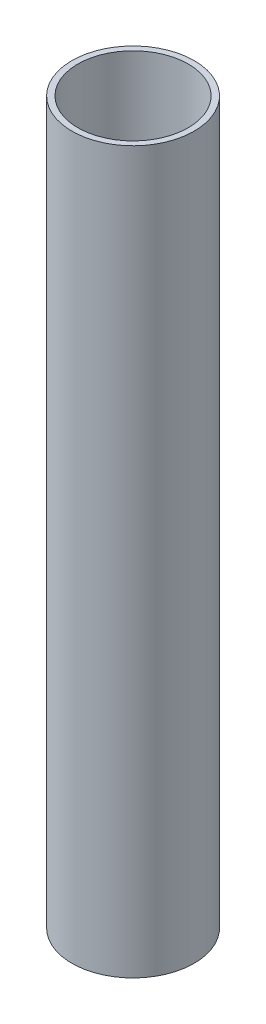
ISO-10303-21;
HEADER;
FILE_DESCRIPTION(('STEP AP214'),'2;1');
FILE_NAME('part.step','',(''),(''),'','','');
FILE_SCHEMA(('AUTOMOTIVE_DESIGN { 1 0 10303 214 1 1 1 1 }'));
ENDSEC;
DATA;
#1=APPLICATION_CONTEXT('core data for automotive mechanical design processes');
#2=APPLICATION_PROTOCOL_DEFINITION('international standard','automotive_design',2000,#1);
#3=PRODUCT_CONTEXT('',#1,'mechanical');
#4=PRODUCT('Part','Part','',(#3));
#5=PRODUCT_RELATED_PRODUCT_CATEGORY('part','',(#4));
#6=PRODUCT_DEFINITION_FORMATION('','',#4);
#7=PRODUCT_DEFINITION_CONTEXT('part definition',#1,'design');
#8=PRODUCT_DEFINITION('design','',#6,#7);
#9=PRODUCT_DEFINITION_SHAPE('','',#8);
#10=(LENGTH_UNIT() NAMED_UNIT(*) SI_UNIT(.MILLI.,.METRE.));
#11=(NAMED_UNIT(*) PLANE_ANGLE_UNIT() SI_UNIT($,.RADIAN.));
#12=(NAMED_UNIT(*) SI_UNIT($,.STERADIAN.) SOLID_ANGLE_UNIT());
#13=UNCERTAINTY_MEASURE_WITH_UNIT(LENGTH_MEASURE(1.E-05),#10,'distance_accuracy_value','');
#14=(GEOMETRIC_REPRESENTATION_CONTEXT(3) GLOBAL_UNCERTAINTY_ASSIGNED_CONTEXT((#13)) GLOBAL_UNIT_ASSIGNED_CONTEXT((#10,
#11,#12)) REPRESENTATION_CONTEXT('',''));
#15=CARTESIAN_POINT('',(0.,0.,0.));
#16=DIRECTION('',(0.,0.,1.));
#17=DIRECTION('',(1.,0.,0.));
#18=AXIS2_PLACEMENT_3D('',#15,#16,#17);
#19=CARTESIAN_POINT('',(0.,122.,0.));
#20=DIRECTION('',(0.,1.,0.));
#21=DIRECTION('',(0.,0.,1.));
#22=AXIS2_PLACEMENT_3D('',#19,#20,#21);
#23=PLANE('',#22);
#24=CARTESIAN_POINT('',(0.,122.,0.));
#25=DIRECTION('',(0.,1.,0.));
#26=DIRECTION('',(0.,0.,1.));
#27=AXIS2_PLACEMENT_3D('',#24,#25,#26);
#28=CIRCLE('',#27,10.35);
#29=CARTESIAN_POINT('',(0.,122.,-10.35));
#30=VERTEX_POINT('',#29);
#31=EDGE_CURVE('E10',#30,#30,#28,.T.);
#32=ORIENTED_EDGE('',*,*,#31,.T.);
#33=EDGE_LOOP('',(#32));
#34=FACE_BOUND('',#33,.T.);
#35=CARTESIAN_POINT('',(0.,122.,0.));
#36=DIRECTION('',(0.,1.,0.));
#37=DIRECTION('',(0.,0.,1.));
#38=AXIS2_PLACEMENT_3D('',#35,#36,#37);
#39=CIRCLE('',#38,9.35);
#40=CARTESIAN_POINT('',(0.,122.,-9.35));
#41=VERTEX_POINT('',#40);
#42=EDGE_CURVE('E56',#41,#41,#39,.T.);
#43=ORIENTED_EDGE('',*,*,#42,.F.);
#44=EDGE_LOOP('',(#43));
#45=FACE_BOUND('',#44,.T.);
#46=ADVANCED_FACE('F43',(#34,#45),#23,.T.);
#47=CARTESIAN_POINT('',(0.,0.,0.));
#48=DIRECTION('',(0.,1.,0.));
#49=DIRECTION('',(0.,0.,1.));
#50=AXIS2_PLACEMENT_3D('',#47,#48,#49);
#51=PLANE('',#50);
#52=CARTESIAN_POINT('',(0.,0.,0.));
#53=DIRECTION('',(0.,1.,0.));
#54=DIRECTION('',(0.,0.,1.));
#55=AXIS2_PLACEMENT_3D('',#52,#53,#54);
#56=CIRCLE('',#55,10.35);
#57=CARTESIAN_POINT('',(0.,0.,-10.35));
#58=VERTEX_POINT('',#57);
#59=EDGE_CURVE('E47',#58,#58,#56,.T.);
#60=ORIENTED_EDGE('',*,*,#59,.F.);
#61=EDGE_LOOP('',(#60));
#62=FACE_BOUND('',#61,.T.);
#63=CARTESIAN_POINT('',(0.,0.,0.));
#64=DIRECTION('',(0.,1.,0.));
#65=DIRECTION('',(0.,0.,1.));
#66=AXIS2_PLACEMENT_3D('',#63,#64,#65);
#67=CIRCLE('',#66,9.35);
#68=CARTESIAN_POINT('',(0.,0.,-9.35));
#69=VERTEX_POINT('',#68);
#70=EDGE_CURVE('E58',#69,#69,#67,.T.);
#71=ORIENTED_EDGE('',*,*,#70,.T.);
#72=EDGE_LOOP('',(#71));
#73=FACE_BOUND('',#72,.T.);
#74=ADVANCED_FACE('F70',(#62,#73),#51,.F.);
#75=CARTESIAN_POINT('',(0.,122.,0.));
#76=DIRECTION('',(0.,-1.,0.));
#77=DIRECTION('',(0.,0.,-1.));
#78=AXIS2_PLACEMENT_3D('',#75,#76,#77);
#79=CYLINDRICAL_SURFACE('',#78,10.35);
#80=CARTESIAN_POINT('',(0.,122.,-10.35));
#81=CARTESIAN_POINT('',(0.,120.729166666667,-10.35));
#82=CARTESIAN_POINT('',(0.,119.458333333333,-10.35));
#83=CARTESIAN_POINT('',(0.,116.916666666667,-10.35));
#84=CARTESIAN_POINT('',(0.,115.645833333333,-10.35));
#85=CARTESIAN_POINT('',(0.,113.104166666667,-10.35));
#86=CARTESIAN_POINT('',(0.,111.833333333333,-10.35));
#87=CARTESIAN_POINT('',(0.,109.291666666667,-10.35));
#88=CARTESIAN_POINT('',(0.,108.020833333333,-10.35));
#89=CARTESIAN_POINT('',(0.,105.479166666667,-10.35));
#90=CARTESIAN_POINT('',(0.,104.208333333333,-10.35));
#91=CARTESIAN_POINT('',(0.,101.666666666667,-10.35));
#92=CARTESIAN_POINT('',(0.,100.395833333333,-10.35));
#93=CARTESIAN_POINT('',(0.,97.8541666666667,-10.35));
#94=CARTESIAN_POINT('',(0.,96.5833333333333,-10.35));
#95=CARTESIAN_POINT('',(0.,94.0416666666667,-10.35));
#96=CARTESIAN_POINT('',(0.,92.7708333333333,-10.35));
#97=CARTESIAN_POINT('',(0.,90.2291666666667,-10.35));
#98=CARTESIAN_POINT('',(0.,88.9583333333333,-10.35));
#99=CARTESIAN_POINT('',(0.,86.4166666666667,-10.35));
#100=CARTESIAN_POINT('',(0.,85.1458333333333,-10.35));
#101=CARTESIAN_POINT('',(0.,82.6041666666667,-10.35));
#102=CARTESIAN_POINT('',(0.,81.3333333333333,-10.35));
#103=CARTESIAN_POINT('',(0.,78.7916666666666,-10.35));
#104=CARTESIAN_POINT('',(0.,77.5208333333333,-10.35));
#105=CARTESIAN_POINT('',(0.,74.9791666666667,-10.35));
#106=CARTESIAN_POINT('',(0.,73.7083333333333,-10.35));
#107=CARTESIAN_POINT('',(0.,71.1666666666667,-10.35));
#108=CARTESIAN_POINT('',(0.,69.8958333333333,-10.35));
#109=CARTESIAN_POINT('',(0.,67.3541666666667,-10.35));
#110=CARTESIAN_POINT('',(0.,66.0833333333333,-10.35));
#111=CARTESIAN_POINT('',(0.,63.5416666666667,-10.35));
#112=CARTESIAN_POINT('',(0.,62.2708333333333,-10.35));
#113=CARTESIAN_POINT('',(0.,59.7291666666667,-10.35));
#114=CARTESIAN_POINT('',(0.,58.4583333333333,-10.35));
#115=CARTESIAN_POINT('',(0.,55.9166666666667,-10.35));
#116=CARTESIAN_POINT('',(0.,54.6458333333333,-10.35));
#117=CARTESIAN_POINT('',(0.,52.1041666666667,-10.35));
#118=CARTESIAN_POINT('',(0.,50.8333333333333,-10.35));
#119=CARTESIAN_POINT('',(0.,48.2916666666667,-10.35));
#120=CARTESIAN_POINT('',(0.,47.0208333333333,-10.35));
#121=CARTESIAN_POINT('',(0.,44.4791666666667,-10.35));
#122=CARTESIAN_POINT('',(0.,43.2083333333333,-10.35));
#123=CARTESIAN_POINT('',(0.,40.6666666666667,-10.35));
#124=CARTESIAN_POINT('',(0.,39.3958333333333,-10.35));
#125=CARTESIAN_POINT('',(0.,36.8541666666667,-10.35));
#126=CARTESIAN_POINT('',(0.,35.5833333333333,-10.35));
#127=CARTESIAN_POINT('',(0.,33.0416666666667,-10.35));
#128=CARTESIAN_POINT('',(0.,31.7708333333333,-10.35));
#129=CARTESIAN_POINT('',(0.,29.2291666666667,-10.35));
#130=CARTESIAN_POINT('',(0.,27.9583333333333,-10.35));
#131=CARTESIAN_POINT('',(0.,25.4166666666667,-10.35));
#132=CARTESIAN_POINT('',(0.,24.1458333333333,-10.35));
#133=CARTESIAN_POINT('',(0.,21.6041666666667,-10.35));
#134=CARTESIAN_POINT('',(0.,20.3333333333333,-10.35));
#135=CARTESIAN_POINT('',(0.,17.7916666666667,-10.35));
#136=CARTESIAN_POINT('',(0.,16.5208333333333,-10.35));
#137=CARTESIAN_POINT('',(0.,13.9791666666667,-10.35));
#138=CARTESIAN_POINT('',(0.,12.7083333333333,-10.35));
#139=CARTESIAN_POINT('',(0.,10.1666666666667,-10.35));
#140=CARTESIAN_POINT('',(0.,8.89583333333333,-10.35));
#141=CARTESIAN_POINT('',(0.,6.35416666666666,-10.35));
#142=CARTESIAN_POINT('',(0.,5.08333333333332,-10.35));
#143=CARTESIAN_POINT('',(0.,2.54166666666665,-10.35));
#144=CARTESIAN_POINT('',(0.,1.27083333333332,-10.35));
#145=CARTESIAN_POINT('',(0.,0.,-10.35));
#146=B_SPLINE_CURVE_WITH_KNOTS('',3,(#80,#81,#82,#83,#84,#85,#86,#87,#88,#89,#90,#91,#92,#93,
#94,#95,#96,#97,#98,#99,#100,#101,#102,#103,#104,#105,#106,#107,#108,#109,#110,#111,#112,#113,
#114,#115,#116,#117,#118,#119,#120,#121,#122,#123,#124,#125,#126,#127,#128,#129,#130,#131,#132,
#133,#134,#135,#136,#137,#138,#139,#140,#141,#142,#143,#144,#145),.UNSPECIFIED.,.F.,.F.,(4,2,2,
2,2,2,2,2,2,2,2,2,2,2,2,2,2,2,2,2,2,2,2,2,2,2,2,2,2,2,2,2,4),(0.,3.81250000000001,
7.62500000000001,11.4375,15.25,19.0625,22.875,26.6875,30.5,34.3125,38.125,41.9375,45.75,49.5625,
53.375,57.1875,61.,64.8125,68.625,72.4375,76.25,80.0625,83.875,87.6875,91.5,95.3125,99.125,
102.9375,106.75,110.5625,114.375,118.1875,122.),.UNSPECIFIED.);
#147=EDGE_CURVE('BSEAM45',#30,#58,#146,.T.);
#148=ORIENTED_EDGE('',*,*,#31,.F.);
#149=ORIENTED_EDGE('',*,*,#59,.T.);
#150=ORIENTED_EDGE('',*,*,#147,.T.);
#151=ORIENTED_EDGE('',*,*,#147,.F.);
#152=EDGE_LOOP('',(#148,#150,#149,#151));
#153=FACE_BOUND('',#152,.T.);
#154=ADVANCED_FACE('F45',(#153),#79,.T.);
#155=CARTESIAN_POINT('',(0.,122.,0.));
#156=DIRECTION('',(0.,-1.,0.));
#157=DIRECTION('',(0.,0.,-1.));
#158=AXIS2_PLACEMENT_3D('',#155,#156,#157);
#159=CYLINDRICAL_SURFACE('',#158,9.35);
#160=CARTESIAN_POINT('',(0.,122.,-9.35));
#161=CARTESIAN_POINT('',(0.,120.729166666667,-9.35));
#162=CARTESIAN_POINT('',(0.,119.458333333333,-9.35));
#163=CARTESIAN_POINT('',(0.,116.916666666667,-9.35));
#164=CARTESIAN_POINT('',(0.,115.645833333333,-9.35));
#165=CARTESIAN_POINT('',(0.,113.104166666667,-9.35));
#166=CARTESIAN_POINT('',(0.,111.833333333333,-9.35));
#167=CARTESIAN_POINT('',(0.,109.291666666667,-9.35));
#168=CARTESIAN_POINT('',(0.,108.020833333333,-9.35));
#169=CARTESIAN_POINT('',(0.,105.479166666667,-9.35));
#170=CARTESIAN_POINT('',(0.,104.208333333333,-9.35));
#171=CARTESIAN_POINT('',(0.,101.666666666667,-9.35));
#172=CARTESIAN_POINT('',(0.,100.395833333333,-9.35));
#173=CARTESIAN_POINT('',(0.,97.8541666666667,-9.35));
#174=CARTESIAN_POINT('',(0.,96.5833333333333,-9.35));
#175=CARTESIAN_POINT('',(0.,94.0416666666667,-9.35));
#176=CARTESIAN_POINT('',(0.,92.7708333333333,-9.35));
#177=CARTESIAN_POINT('',(0.,90.2291666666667,-9.35));
#178=CARTESIAN_POINT('',(0.,88.9583333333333,-9.35));
#179=CARTESIAN_POINT('',(0.,86.4166666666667,-9.35));
#180=CARTESIAN_POINT('',(0.,85.1458333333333,-9.35));
#181=CARTESIAN_POINT('',(0.,82.6041666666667,-9.35));
#182=CARTESIAN_POINT('',(0.,81.3333333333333,-9.35));
#183=CARTESIAN_POINT('',(0.,78.7916666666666,-9.35));
#184=CARTESIAN_POINT('',(0.,77.5208333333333,-9.35));
#185=CARTESIAN_POINT('',(0.,74.9791666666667,-9.35));
#186=CARTESIAN_POINT('',(0.,73.7083333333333,-9.35));
#187=CARTESIAN_POINT('',(0.,71.1666666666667,-9.35));
#188=CARTESIAN_POINT('',(0.,69.8958333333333,-9.35));
#189=CARTESIAN_POINT('',(0.,67.3541666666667,-9.35));
#190=CARTESIAN_POINT('',(0.,66.0833333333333,-9.35));
#191=CARTESIAN_POINT('',(0.,63.5416666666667,-9.35));
#192=CARTESIAN_POINT('',(0.,62.2708333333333,-9.35));
#193=CARTESIAN_POINT('',(0.,59.7291666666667,-9.35));
#194=CARTESIAN_POINT('',(0.,58.4583333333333,-9.35));
#195=CARTESIAN_POINT('',(0.,55.9166666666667,-9.35));
#196=CARTESIAN_POINT('',(0.,54.6458333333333,-9.35));
#197=CARTESIAN_POINT('',(0.,52.1041666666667,-9.35));
#198=CARTESIAN_POINT('',(0.,50.8333333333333,-9.35));
#199=CARTESIAN_POINT('',(0.,48.2916666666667,-9.35));
#200=CARTESIAN_POINT('',(0.,47.0208333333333,-9.35));
#201=CARTESIAN_POINT('',(0.,44.4791666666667,-9.35));
#202=CARTESIAN_POINT('',(0.,43.2083333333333,-9.35));
#203=CARTESIAN_POINT('',(0.,40.6666666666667,-9.35));
#204=CARTESIAN_POINT('',(0.,39.3958333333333,-9.35));
#205=CARTESIAN_POINT('',(0.,36.8541666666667,-9.35));
#206=CARTESIAN_POINT('',(0.,35.5833333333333,-9.35));
#207=CARTESIAN_POINT('',(0.,33.0416666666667,-9.35));
#208=CARTESIAN_POINT('',(0.,31.7708333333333,-9.35));
#209=CARTESIAN_POINT('',(0.,29.2291666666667,-9.35));
#210=CARTESIAN_POINT('',(0.,27.9583333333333,-9.35));
#211=CARTESIAN_POINT('',(0.,25.4166666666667,-9.35));
#212=CARTESIAN_POINT('',(0.,24.1458333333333,-9.35));
#213=CARTESIAN_POINT('',(0.,21.6041666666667,-9.35));
#214=CARTESIAN_POINT('',(0.,20.3333333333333,-9.35));
#215=CARTESIAN_POINT('',(0.,17.7916666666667,-9.35));
#216=CARTESIAN_POINT('',(0.,16.5208333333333,-9.35));
#217=CARTESIAN_POINT('',(0.,13.9791666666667,-9.35));
#218=CARTESIAN_POINT('',(0.,12.7083333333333,-9.35));
#219=CARTESIAN_POINT('',(0.,10.1666666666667,-9.35));
#220=CARTESIAN_POINT('',(0.,8.89583333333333,-9.35));
#221=CARTESIAN_POINT('',(0.,6.35416666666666,-9.35));
#222=CARTESIAN_POINT('',(0.,5.08333333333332,-9.35));
#223=CARTESIAN_POINT('',(0.,2.54166666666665,-9.35));
#224=CARTESIAN_POINT('',(0.,1.27083333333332,-9.35));
#225=CARTESIAN_POINT('',(0.,0.,-9.35));
#226=B_SPLINE_CURVE_WITH_KNOTS('',3,(#160,#161,#162,#163,#164,#165,#166,#167,#168,#169,#170,
#171,#172,#173,#174,#175,#176,#177,#178,#179,#180,#181,#182,#183,#184,#185,#186,#187,#188,#189,
#190,#191,#192,#193,#194,#195,#196,#197,#198,#199,#200,#201,#202,#203,#204,#205,#206,#207,#208,
#209,#210,#211,#212,#213,#214,#215,#216,#217,#218,#219,#220,#221,#222,#223,#224,#225),
.UNSPECIFIED.,.F.,.F.,(4,2,2,2,2,2,2,2,2,2,2,2,2,2,2,2,2,2,2,2,2,2,2,2,2,2,2,2,2,2,2,2,4),(0.,
3.81250000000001,7.62500000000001,11.4375,15.25,19.0625,22.875,26.6875,30.5,34.3125,38.125,
41.9375,45.75,49.5625,53.375,57.1875,61.,64.8125,68.625,72.4375,76.25,80.0625,83.875,87.6875,
91.5,95.3125,99.125,102.9375,106.75,110.5625,114.375,118.1875,122.),.UNSPECIFIED.);
#227=EDGE_CURVE('BSEAM66',#41,#69,#226,.T.);
#228=ORIENTED_EDGE('',*,*,#42,.T.);
#229=ORIENTED_EDGE('',*,*,#70,.F.);
#230=ORIENTED_EDGE('',*,*,#227,.T.);
#231=ORIENTED_EDGE('',*,*,#227,.F.);
#232=EDGE_LOOP('',(#228,#230,#229,#231));
#233=FACE_BOUND('',#232,.T.);
#234=ADVANCED_FACE('F66',(#233),#159,.F.);
#235=CLOSED_SHELL('',(#46,#74,#154,#234));
#236=MANIFOLD_SOLID_BREP('B2',#235);
#237=ADVANCED_BREP_SHAPE_REPRESENTATION('',(#18,#236),#14);
#238=SHAPE_DEFINITION_REPRESENTATION(#9,#237);
ENDSEC;
END-ISO-10303-21;
